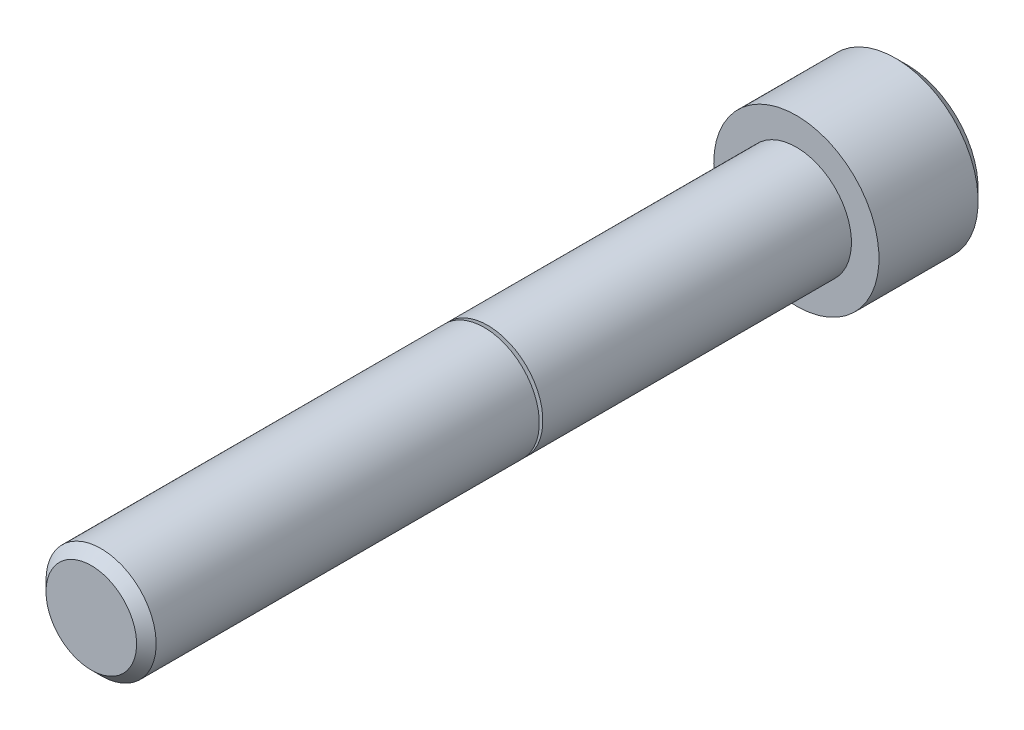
from build123d import *

# Parameters (mm, degrees)
CUT_EXTRUDE1_DEPTH = 3.96875


with BuildPart() as part:
    # Logo3_bib1 → Revolve1 (revolve)
    with BuildSketch(Plane(origin=(0, 0, 0), x_dir=(-1, 0, 0), z_dir=(0, -1, 0))):
        with BuildLine():
            Line((0, -50.8), (0, 7.9375))
            Line((0, 7.9375), (5.159375, 7.9375))
            Line((5.159375, 7.9375), (5.953125, 7.14375))
            Line((5.953125, 7.14375), (5.953125, 0))
            Line((5.953125, 0), (3.96875, 0))
            Line((3.96875, 0), (3.96875, -22.235))
            Line((3.96875, -22.235), (3.377325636, -22.235))
            ThreePointArc((3.377325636, -22.235), (3.357629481, -22.251527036), (3.370485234, -22.273793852))
            Line((3.370485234, -22.273793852), (3.96875, -22.49154442))
            Line((3.96875, -22.49154442), (3.96875, -50.09515))
            Line((3.96875, -50.09515), (3.2639, -50.8))
            Line((3.2639, -50.8), (0, -50.8))
        make_face()
    revolve(axis=Axis((0, 0, -10.585154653), (0, 0, 1)))

    # Logo3_bib2 → Cut-Extrude1 (cut)
    with BuildSketch(Plane(origin=(0, 0, -7.9375), x_dir=(1, 0, 0), z_dir=(0, 0, -1))):
        Polygon((3.666174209, 0), (1.833087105, 3.175), (-1.833087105, 3.175), (-3.666174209, 0), (-1.833087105, -3.175), (1.833087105, -3.175), align=None)
    extrude(amount=-CUT_EXTRUDE1_DEPTH, mode=Mode.SUBTRACT)


solid = part.part
